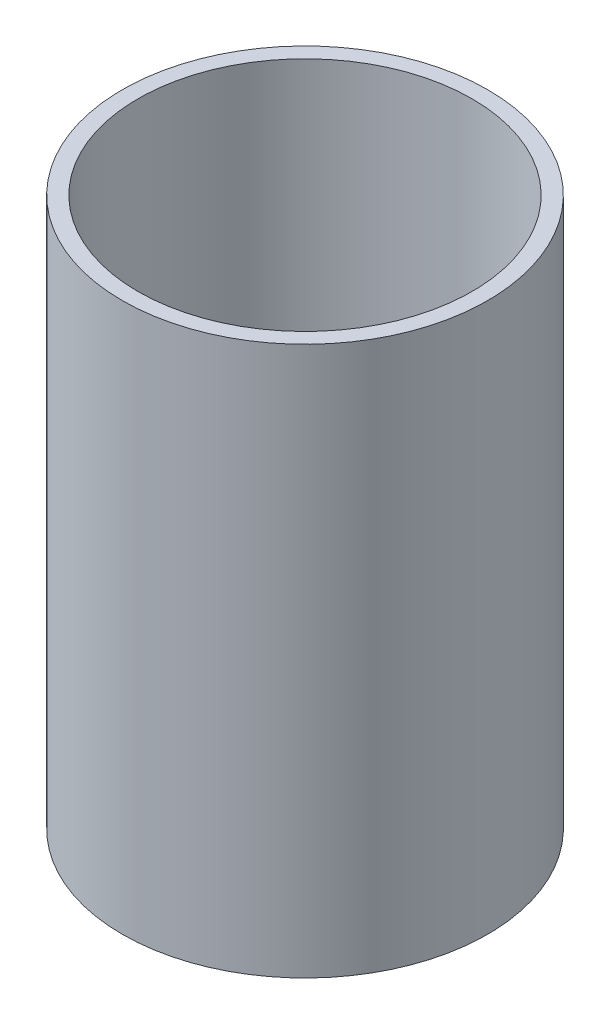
from build123d import *

# Parameters (mm, degrees)
SKETCH1_R           = 11.65
SKETCH1_R_2         = 10.65
BOSS_EXTRUDE1_DEPTH = 35


with BuildPart() as part:
    # Sketch1 → Boss-Extrude1 (new body)
    with BuildSketch(Plane(origin=(0, 0, 0), x_dir=(0.9991103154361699, 0, -0.04217318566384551), z_dir=(0, 1, 0))):
        with Locations(Location((28.542888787, 18.957113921, 0), (0, 0, 267.582937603))):
            Circle(SKETCH1_R)
        with Locations(Location((28.542888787, 18.957113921, 0), (0, 0, 267.582937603))):
            Circle(SKETCH1_R_2, mode=Mode.SUBTRACT)
    extrude(amount=BOSS_EXTRUDE1_DEPTH)


solid = part.part
